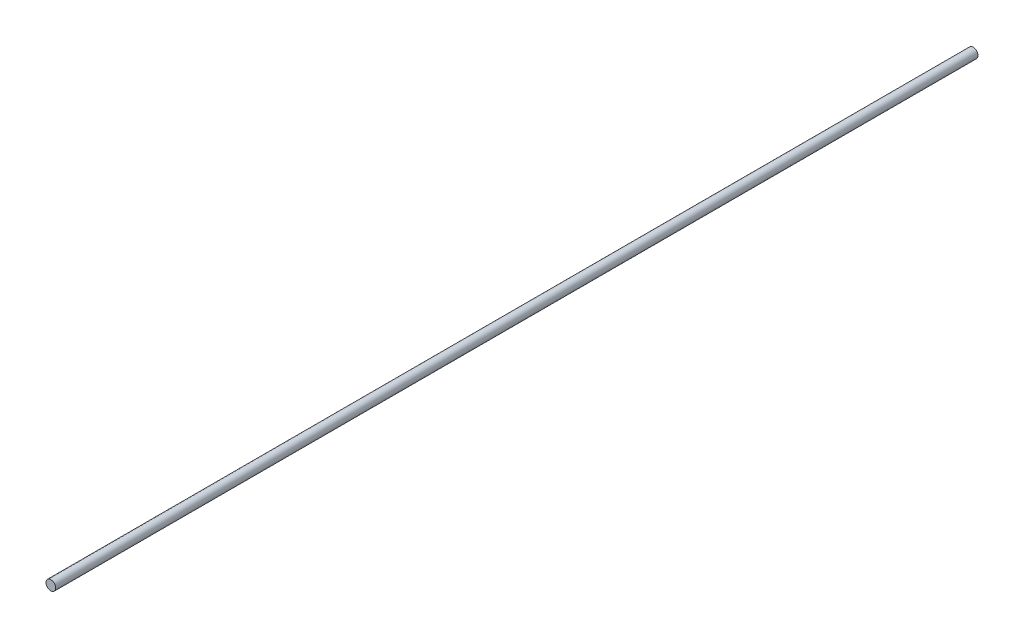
ISO-10303-21;
HEADER;
FILE_DESCRIPTION(('STEP AP214'),'2;1');
FILE_NAME('part.step','',(''),(''),'','','');
FILE_SCHEMA(('AUTOMOTIVE_DESIGN { 1 0 10303 214 1 1 1 1 }'));
ENDSEC;
DATA;
#1=APPLICATION_CONTEXT('core data for automotive mechanical design processes');
#2=APPLICATION_PROTOCOL_DEFINITION('international standard','automotive_design',2000,#1);
#3=PRODUCT_CONTEXT('',#1,'mechanical');
#4=PRODUCT('Part','Part','',(#3));
#5=PRODUCT_RELATED_PRODUCT_CATEGORY('part','',(#4));
#6=PRODUCT_DEFINITION_FORMATION('','',#4);
#7=PRODUCT_DEFINITION_CONTEXT('part definition',#1,'design');
#8=PRODUCT_DEFINITION('design','',#6,#7);
#9=PRODUCT_DEFINITION_SHAPE('','',#8);
#10=(LENGTH_UNIT() NAMED_UNIT(*) SI_UNIT(.MILLI.,.METRE.));
#11=(NAMED_UNIT(*) PLANE_ANGLE_UNIT() SI_UNIT($,.RADIAN.));
#12=(NAMED_UNIT(*) SI_UNIT($,.STERADIAN.) SOLID_ANGLE_UNIT());
#13=UNCERTAINTY_MEASURE_WITH_UNIT(LENGTH_MEASURE(1.E-05),#10,'distance_accuracy_value','');
#14=(GEOMETRIC_REPRESENTATION_CONTEXT(3) GLOBAL_UNCERTAINTY_ASSIGNED_CONTEXT((#13)) GLOBAL_UNIT_ASSIGNED_CONTEXT((#10,
#11,#12)) REPRESENTATION_CONTEXT('',''));
#15=CARTESIAN_POINT('',(0.,0.,0.));
#16=DIRECTION('',(0.,0.,1.));
#17=DIRECTION('',(1.,0.,0.));
#18=AXIS2_PLACEMENT_3D('',#15,#16,#17);
#19=CARTESIAN_POINT('',(0.,0.,-5700.));
#20=DIRECTION('',(0.,0.,1.));
#21=DIRECTION('',(1.,0.,0.));
#22=AXIS2_PLACEMENT_3D('',#19,#20,#21);
#23=CYLINDRICAL_SURFACE('',#22,30.);
#24=CARTESIAN_POINT('',(0.,0.,-5700.));
#25=DIRECTION('',(0.,0.,1.));
#26=DIRECTION('',(1.,0.,0.));
#27=AXIS2_PLACEMENT_3D('',#24,#25,#26);
#28=CIRCLE('',#27,30.);
#29=CARTESIAN_POINT('',(30.,0.,-5700.));
#30=VERTEX_POINT('',#29);
#31=EDGE_CURVE('E10',#30,#30,#28,.T.);
#32=ORIENTED_EDGE('',*,*,#31,.T.);
#33=EDGE_LOOP('',(#32));
#34=FACE_BOUND('',#33,.T.);
#35=CARTESIAN_POINT('',(0.,0.,0.));
#36=DIRECTION('',(0.,0.,1.));
#37=DIRECTION('',(1.,0.,0.));
#38=AXIS2_PLACEMENT_3D('',#35,#36,#37);
#39=CIRCLE('',#38,30.);
#40=CARTESIAN_POINT('',(30.,0.,0.));
#41=VERTEX_POINT('',#40);
#42=EDGE_CURVE('E40',#41,#41,#39,.T.);
#43=ORIENTED_EDGE('',*,*,#42,.F.);
#44=EDGE_LOOP('',(#43));
#45=FACE_BOUND('',#44,.T.);
#46=ADVANCED_FACE('F37',(#34,#45),#23,.T.);
#47=CARTESIAN_POINT('',(0.,0.,-5700.));
#48=DIRECTION('',(0.,0.,1.));
#49=DIRECTION('',(1.,0.,0.));
#50=AXIS2_PLACEMENT_3D('',#47,#48,#49);
#51=PLANE('',#50);
#52=ORIENTED_EDGE('',*,*,#31,.F.);
#53=EDGE_LOOP('',(#52));
#54=FACE_BOUND('',#53,.T.);
#55=ADVANCED_FACE('F54',(#54),#51,.F.);
#56=CARTESIAN_POINT('',(0.,0.,0.));
#57=DIRECTION('',(0.,0.,1.));
#58=DIRECTION('',(1.,0.,0.));
#59=AXIS2_PLACEMENT_3D('',#56,#57,#58);
#60=PLANE('',#59);
#61=ORIENTED_EDGE('',*,*,#42,.T.);
#62=EDGE_LOOP('',(#61));
#63=FACE_BOUND('',#62,.T.);
#64=ADVANCED_FACE('F51',(#63),#60,.T.);
#65=CLOSED_SHELL('',(#46,#55,#64));
#66=MANIFOLD_SOLID_BREP('B2',#65);
#67=ADVANCED_BREP_SHAPE_REPRESENTATION('',(#18,#66),#14);
#68=SHAPE_DEFINITION_REPRESENTATION(#9,#67);
ENDSEC;
END-ISO-10303-21;
